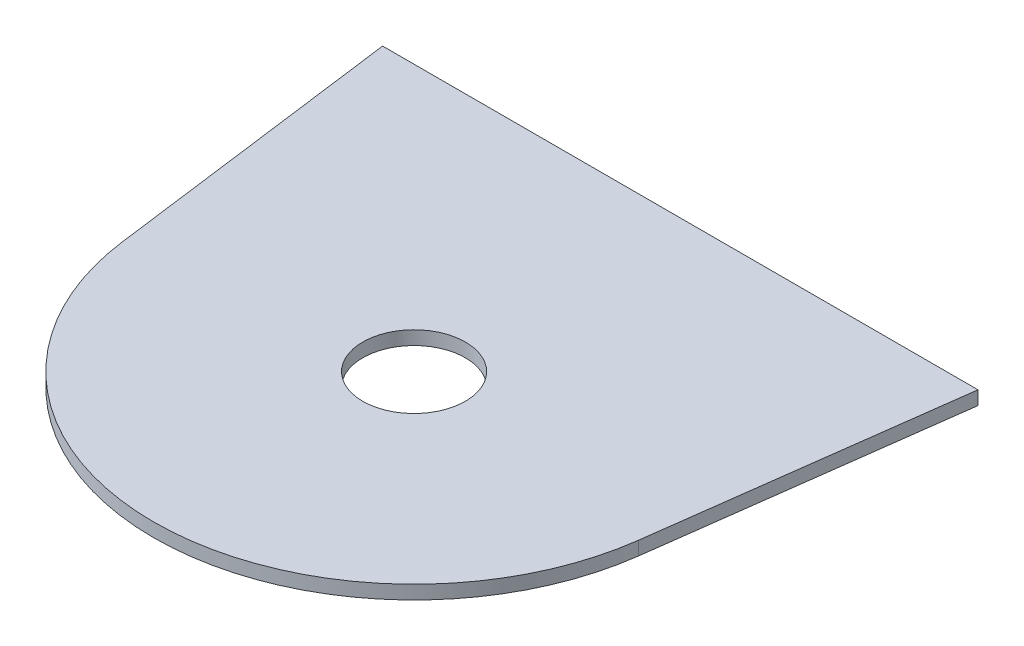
ISO-10303-21;
HEADER;
FILE_DESCRIPTION(('STEP AP214'),'2;1');
FILE_NAME('part.step','',(''),(''),'','','');
FILE_SCHEMA(('AUTOMOTIVE_DESIGN { 1 0 10303 214 1 1 1 1 }'));
ENDSEC;
DATA;
#1=APPLICATION_CONTEXT('core data for automotive mechanical design processes');
#2=APPLICATION_PROTOCOL_DEFINITION('international standard','automotive_design',2000,#1);
#3=PRODUCT_CONTEXT('',#1,'mechanical');
#4=PRODUCT('Part','Part','',(#3));
#5=PRODUCT_RELATED_PRODUCT_CATEGORY('part','',(#4));
#6=PRODUCT_DEFINITION_FORMATION('','',#4);
#7=PRODUCT_DEFINITION_CONTEXT('part definition',#1,'design');
#8=PRODUCT_DEFINITION('design','',#6,#7);
#9=PRODUCT_DEFINITION_SHAPE('','',#8);
#10=(LENGTH_UNIT() NAMED_UNIT(*) SI_UNIT(.MILLI.,.METRE.));
#11=(NAMED_UNIT(*) PLANE_ANGLE_UNIT() SI_UNIT($,.RADIAN.));
#12=(NAMED_UNIT(*) SI_UNIT($,.STERADIAN.) SOLID_ANGLE_UNIT());
#13=UNCERTAINTY_MEASURE_WITH_UNIT(LENGTH_MEASURE(1.E-05),#10,'distance_accuracy_value','');
#14=(GEOMETRIC_REPRESENTATION_CONTEXT(3) GLOBAL_UNCERTAINTY_ASSIGNED_CONTEXT((#13)) GLOBAL_UNIT_ASSIGNED_CONTEXT((#10,
#11,#12)) REPRESENTATION_CONTEXT('',''));
#15=CARTESIAN_POINT('',(0.,0.,0.));
#16=DIRECTION('',(0.,0.,1.));
#17=DIRECTION('',(1.,0.,0.));
#18=AXIS2_PLACEMENT_3D('',#15,#16,#17);
#19=CARTESIAN_POINT('',(0.,2.,0.));
#20=DIRECTION('',(0.,1.,0.));
#21=DIRECTION('',(0.,0.,1.));
#22=AXIS2_PLACEMENT_3D('',#19,#20,#21);
#23=PLANE('',#22);
#24=CARTESIAN_POINT('',(0.,2.,0.));
#25=DIRECTION('',(0.,1.,0.));
#26=DIRECTION('',(0.,0.,1.));
#27=AXIS2_PLACEMENT_3D('',#24,#25,#26);
#28=CIRCLE('',#27,7.5);
#29=CARTESIAN_POINT('',(0.,2.,7.5));
#30=VERTEX_POINT('',#29);
#31=EDGE_CURVE('E152',#30,#30,#28,.T.);
#32=ORIENTED_EDGE('',*,*,#31,.F.);
#33=EDGE_LOOP('',(#32));
#34=FACE_BOUND('',#33,.T.);
#35=DIRECTION('',(-1.,0.,0.));
#36=VECTOR('',#35,1.);
#37=CARTESIAN_POINT('',(43.5,2.,-38.90293115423));
#38=LINE('',#37,#36);
#39=CARTESIAN_POINT('',(-43.5,2.,-38.90293115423));
#40=VERTEX_POINT('',#39);
#41=CARTESIAN_POINT('',(43.4999999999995,2.,-38.9029311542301));
#42=VERTEX_POINT('',#41);
#43=EDGE_CURVE('E84',#40,#42,#38,.F.);
#44=ORIENTED_EDGE('',*,*,#43,.F.);
#45=DIRECTION('',(0.130526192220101,0.,0.991444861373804));
#46=VECTOR('',#45,1.);
#47=CARTESIAN_POINT('',(-43.5,2.,-38.90293115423));
#48=LINE('',#47,#46);
#49=CARTESIAN_POINT('',(-37.7244769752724,2.,4.96652161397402));
#50=VERTEX_POINT('',#49);
#51=EDGE_CURVE('E82',#50,#40,#48,.F.);
#52=ORIENTED_EDGE('',*,*,#51,.F.);
#53=CARTESIAN_POINT('',(0.,2.,0.));
#54=DIRECTION('',(0.,1.,0.));
#55=DIRECTION('',(0.,0.,1.));
#56=AXIS2_PLACEMENT_3D('',#53,#54,#55);
#57=CIRCLE('',#56,38.05);
#58=CARTESIAN_POINT('',(37.7244769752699,2.,4.96652161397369));
#59=VERTEX_POINT('',#58);
#60=EDGE_CURVE('E73',#59,#50,#57,.F.);
#61=ORIENTED_EDGE('',*,*,#60,.F.);
#62=DIRECTION('',(0.130526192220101,0.,-0.991444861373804));
#63=VECTOR('',#62,1.);
#64=CARTESIAN_POINT('',(37.72447697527,2.,4.966521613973));
#65=LINE('',#64,#63);
#66=EDGE_CURVE('E68',#42,#59,#65,.F.);
#67=ORIENTED_EDGE('',*,*,#66,.F.);
#68=EDGE_LOOP('',(#44,#52,#61,#67));
#69=FACE_BOUND('',#68,.T.);
#70=ADVANCED_FACE('F32',(#34,#69),#23,.T.);
#71=CARTESIAN_POINT('',(-43.5,0.,-38.90293115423));
#72=DIRECTION('',(-0.991444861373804,0.,0.130526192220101));
#73=DIRECTION('',(0.130526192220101,0.,0.991444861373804));
#74=AXIS2_PLACEMENT_3D('',#71,#72,#73);
#75=PLANE('',#74);
#76=DIRECTION('',(0.,1.,0.));
#77=VECTOR('',#76,1.);
#78=CARTESIAN_POINT('',(-43.5,0.,-38.90293115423));
#79=LINE('',#78,#77);
#80=CARTESIAN_POINT('',(-43.5,0.,-38.90293115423));
#81=VERTEX_POINT('',#80);
#82=EDGE_CURVE('E98',#81,#40,#79,.T.);
#83=ORIENTED_EDGE('',*,*,#82,.F.);
#84=DIRECTION('',(0.130526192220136,0.,0.991444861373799));
#85=VECTOR('',#84,1.);
#86=CARTESIAN_POINT('',(-43.5,0.,-38.90293115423));
#87=LINE('',#86,#85);
#88=CARTESIAN_POINT('',(-37.7244769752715,0.,4.96652161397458));
#89=VERTEX_POINT('',#88);
#90=EDGE_CURVE('E91',#81,#89,#87,.T.);
#91=ORIENTED_EDGE('',*,*,#90,.T.);
#92=DIRECTION('',(0.,1.,0.));
#93=VECTOR('',#92,1.);
#94=CARTESIAN_POINT('',(-37.7244769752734,0.,4.96652161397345));
#95=LINE('',#94,#93);
#96=EDGE_CURVE('E78',#50,#89,#95,.F.);
#97=ORIENTED_EDGE('',*,*,#96,.F.);
#98=ORIENTED_EDGE('',*,*,#51,.T.);
#99=EDGE_LOOP('',(#83,#91,#97,#98));
#100=FACE_BOUND('',#99,.T.);
#101=ADVANCED_FACE('F90',(#100),#75,.T.);
#102=CARTESIAN_POINT('',(0.,0.,0.));
#103=DIRECTION('',(0.,1.,0.));
#104=DIRECTION('',(0.,0.,1.));
#105=AXIS2_PLACEMENT_3D('',#102,#103,#104);
#106=CYLINDRICAL_SURFACE('',#105,38.05);
#107=ORIENTED_EDGE('',*,*,#96,.T.);
#108=CARTESIAN_POINT('',(0.,0.,0.));
#109=DIRECTION('',(0.,1.,0.));
#110=DIRECTION('',(0.,0.,1.));
#111=AXIS2_PLACEMENT_3D('',#108,#109,#110);
#112=CIRCLE('',#111,38.05);
#113=CARTESIAN_POINT('',(37.7244769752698,0.,4.96652161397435));
#114=VERTEX_POINT('',#113);
#115=EDGE_CURVE('E109',#89,#114,#112,.T.);
#116=ORIENTED_EDGE('',*,*,#115,.T.);
#117=DIRECTION('',(0.,1.,0.));
#118=VECTOR('',#117,1.);
#119=CARTESIAN_POINT('',(37.72447697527,0.,4.966521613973));
#120=LINE('',#119,#118);
#121=EDGE_CURVE('E80',#59,#114,#120,.F.);
#122=ORIENTED_EDGE('',*,*,#121,.F.);
#123=ORIENTED_EDGE('',*,*,#60,.T.);
#124=EDGE_LOOP('',(#107,#116,#122,#123));
#125=FACE_BOUND('',#124,.T.);
#126=ADVANCED_FACE('F75',(#125),#106,.T.);
#127=CARTESIAN_POINT('',(37.72447697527,0.,4.966521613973));
#128=DIRECTION('',(0.991444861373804,0.,0.130526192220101));
#129=DIRECTION('',(0.130526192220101,0.,-0.991444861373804));
#130=AXIS2_PLACEMENT_3D('',#127,#128,#129);
#131=PLANE('',#130);
#132=ORIENTED_EDGE('',*,*,#121,.T.);
#133=DIRECTION('',(0.130526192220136,0.,-0.991444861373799));
#134=VECTOR('',#133,1.);
#135=CARTESIAN_POINT('',(37.72447697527,0.,4.966521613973));
#136=LINE('',#135,#134);
#137=CARTESIAN_POINT('',(43.5,0.,-38.90293115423));
#138=VERTEX_POINT('',#137);
#139=EDGE_CURVE('E41',#114,#138,#136,.T.);
#140=ORIENTED_EDGE('',*,*,#139,.T.);
#141=DIRECTION('',(0.,1.,0.));
#142=VECTOR('',#141,1.);
#143=CARTESIAN_POINT('',(43.5,0.,-38.90293115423));
#144=LINE('',#143,#142);
#145=EDGE_CURVE('E49',#42,#138,#144,.F.);
#146=ORIENTED_EDGE('',*,*,#145,.F.);
#147=ORIENTED_EDGE('',*,*,#66,.T.);
#148=EDGE_LOOP('',(#132,#140,#146,#147));
#149=FACE_BOUND('',#148,.T.);
#150=ADVANCED_FACE('F121',(#149),#131,.T.);
#151=CARTESIAN_POINT('',(43.5,0.,-38.90293115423));
#152=DIRECTION('',(0.,0.,-1.));
#153=DIRECTION('',(-1.,0.,0.));
#154=AXIS2_PLACEMENT_3D('',#151,#152,#153);
#155=PLANE('',#154);
#156=ORIENTED_EDGE('',*,*,#145,.T.);
#157=DIRECTION('',(1.,0.,0.));
#158=VECTOR('',#157,1.);
#159=CARTESIAN_POINT('',(0.,0.,-38.90293115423));
#160=LINE('',#159,#158);
#161=EDGE_CURVE('E11',#138,#81,#160,.F.);
#162=ORIENTED_EDGE('',*,*,#161,.T.);
#163=ORIENTED_EDGE('',*,*,#82,.T.);
#164=ORIENTED_EDGE('',*,*,#43,.T.);
#165=EDGE_LOOP('',(#156,#162,#163,#164));
#166=FACE_BOUND('',#165,.T.);
#167=ADVANCED_FACE('F124',(#166),#155,.T.);
#168=CARTESIAN_POINT('',(0.,0.,0.));
#169=DIRECTION('',(0.,1.,0.));
#170=DIRECTION('',(0.,0.,1.));
#171=AXIS2_PLACEMENT_3D('',#168,#169,#170);
#172=PLANE('',#171);
#173=CARTESIAN_POINT('',(0.,0.,0.));
#174=DIRECTION('',(0.,1.,0.));
#175=DIRECTION('',(0.,0.,1.));
#176=AXIS2_PLACEMENT_3D('',#173,#174,#175);
#177=CIRCLE('',#176,7.5);
#178=CARTESIAN_POINT('',(0.,0.,7.5));
#179=VERTEX_POINT('',#178);
#180=EDGE_CURVE('E35',#179,#179,#177,.T.);
#181=ORIENTED_EDGE('',*,*,#180,.T.);
#182=EDGE_LOOP('',(#181));
#183=FACE_BOUND('',#182,.T.);
#184=ORIENTED_EDGE('',*,*,#139,.F.);
#185=ORIENTED_EDGE('',*,*,#115,.F.);
#186=ORIENTED_EDGE('',*,*,#90,.F.);
#187=ORIENTED_EDGE('',*,*,#161,.F.);
#188=EDGE_LOOP('',(#184,#185,#186,#187));
#189=FACE_BOUND('',#188,.T.);
#190=ADVANCED_FACE('F123',(#183,#189),#172,.F.);
#191=CARTESIAN_POINT('',(0.,-0.00010307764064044,0.));
#192=DIRECTION('',(0.,1.,0.));
#193=DIRECTION('',(0.,0.,1.));
#194=AXIS2_PLACEMENT_3D('',#191,#192,#193);
#195=CYLINDRICAL_SURFACE('',#194,7.5);
#196=ORIENTED_EDGE('',*,*,#31,.T.);
#197=EDGE_LOOP('',(#196));
#198=FACE_BOUND('',#197,.T.);
#199=ORIENTED_EDGE('',*,*,#180,.F.);
#200=EDGE_LOOP('',(#199));
#201=FACE_BOUND('',#200,.T.);
#202=ADVANCED_FACE('F131',(#198,#201),#195,.F.);
#203=CLOSED_SHELL('',(#70,#101,#126,#150,#167,#190,#202));
#204=MANIFOLD_SOLID_BREP('B2',#203);
#205=ADVANCED_BREP_SHAPE_REPRESENTATION('',(#18,#204),#14);
#206=SHAPE_DEFINITION_REPRESENTATION(#9,#205);
ENDSEC;
END-ISO-10303-21;
